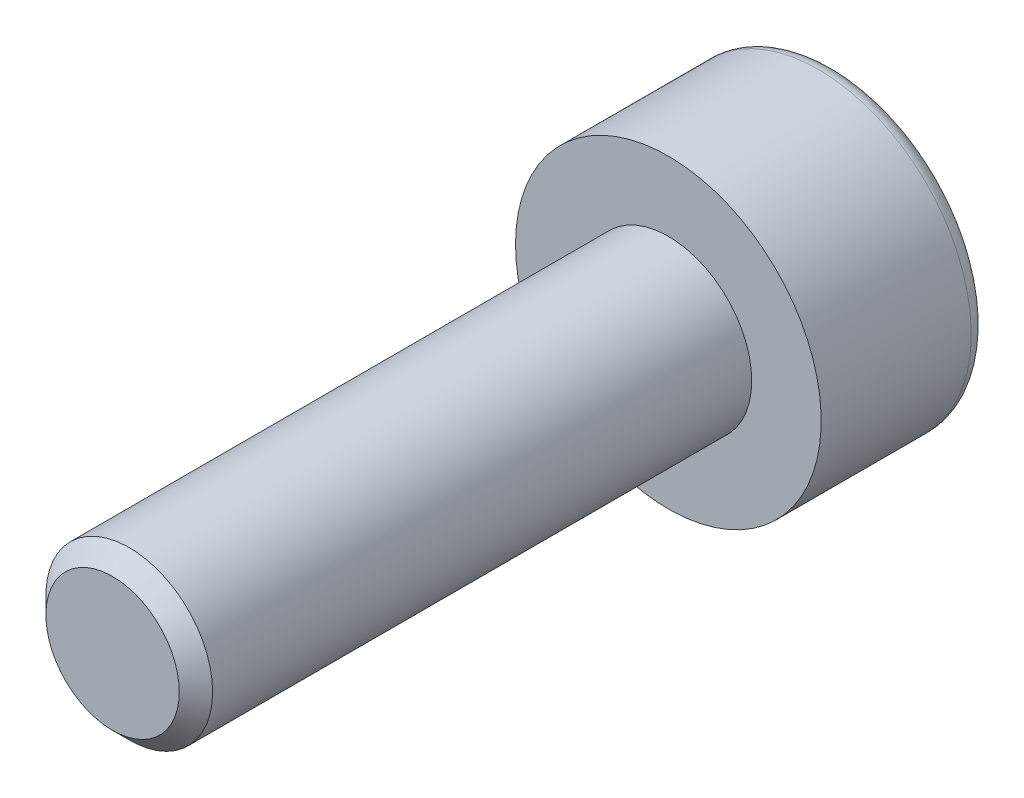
from build123d import *

# Parameters (mm, degrees)
ENLEV_MAT_EXTRU1_DEPTH = 1.3
ESQUISSE3_W            = 1.5
ESQUISSE3_H            = 10
CHANFREIN1_SIZE        = 0.3


with BuildPart() as part:
    # Esquisse1 → Base-R_volution (revolve)
    with BuildSketch(Plane(origin=(0, 0, 0), x_dir=(1, 0, 0), z_dir=(0, 1, 0)), mode=Mode.PRIVATE) as base_r_volution_sk:
        with BuildLine():
            Line((0, 0), (2.75, 0))
            Line((2.75, 0), (2.75, 2.7))
            ThreePointArc((2.75, 2.7), (2.662132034, 2.912132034), (2.45, 3))
            Line((2.45, 3), (0, 3))
            Line((0, 3), (0, 0))
        make_face()
    revolve(base_r_volution_sk.sketch.rotate(Axis((0, 0, 0), (0, 0, -1)), 180), axis=Axis((0, 0, 0), (0, 0, -1)))

    # Esquisse2 → enlev-mat-Extru1 (cut)
    with BuildSketch(Plane.XY.offset(-3)):
        Polygon((1.25, -0.721687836), (1.25, 0.721687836), (0, 1.443375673), (-1.25, 0.721687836), (-1.25, -0.721687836), (0, -1.443375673), align=None)
    extrude(amount=ENLEV_MAT_EXTRU1_DEPTH, mode=Mode.SUBTRACT)

    # Esquisse3 → Boss.-R_vol.1 (revolve)
    with BuildSketch(Plane(origin=(0, 0, 0), x_dir=(1, 0, 0), z_dir=(0, 1, 0))):
        with Locations((0.75, -5)):
            Rectangle(ESQUISSE3_W, ESQUISSE3_H)
    revolve(axis=Axis((0, 0, 0), (0, 0, 1)))

    # Chanfrein1
    chanfrein1_edges = [part.edges().sort_by_distance(p)[0] for p in [
        (-1.5, 0, 10),
    ]]
    chamfer(chanfrein1_edges, length=CHANFREIN1_SIZE)


solid = part.part
